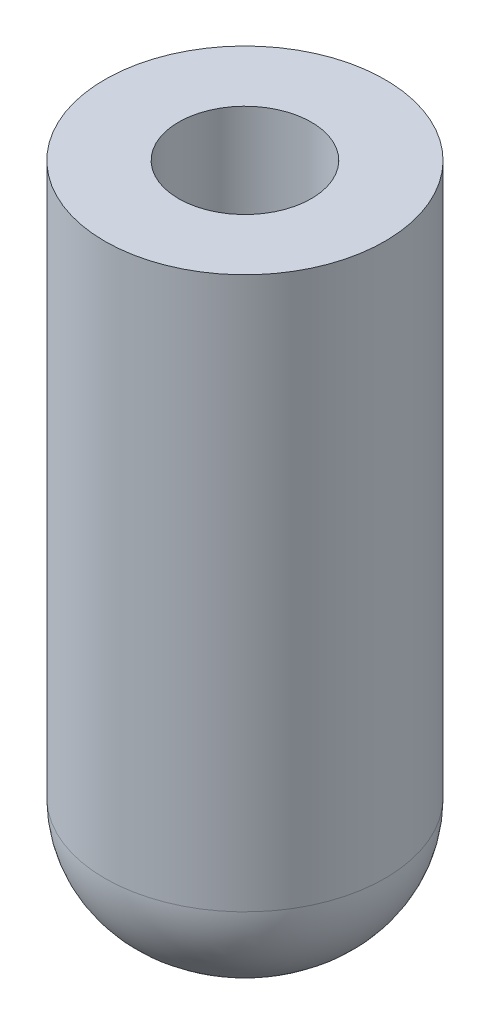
ISO-10303-21;
HEADER;
FILE_DESCRIPTION(('STEP AP214'),'2;1');
FILE_NAME('part.step','',(''),(''),'','','');
FILE_SCHEMA(('AUTOMOTIVE_DESIGN { 1 0 10303 214 1 1 1 1 }'));
ENDSEC;
DATA;
#1=APPLICATION_CONTEXT('core data for automotive mechanical design processes');
#2=APPLICATION_PROTOCOL_DEFINITION('international standard','automotive_design',2000,#1);
#3=PRODUCT_CONTEXT('',#1,'mechanical');
#4=PRODUCT('Part','Part','',(#3));
#5=PRODUCT_RELATED_PRODUCT_CATEGORY('part','',(#4));
#6=PRODUCT_DEFINITION_FORMATION('','',#4);
#7=PRODUCT_DEFINITION_CONTEXT('part definition',#1,'design');
#8=PRODUCT_DEFINITION('design','',#6,#7);
#9=PRODUCT_DEFINITION_SHAPE('','',#8);
#10=(LENGTH_UNIT() NAMED_UNIT(*) SI_UNIT(.MILLI.,.METRE.));
#11=(NAMED_UNIT(*) PLANE_ANGLE_UNIT() SI_UNIT($,.RADIAN.));
#12=(NAMED_UNIT(*) SI_UNIT($,.STERADIAN.) SOLID_ANGLE_UNIT());
#13=UNCERTAINTY_MEASURE_WITH_UNIT(LENGTH_MEASURE(1.E-05),#10,'distance_accuracy_value','');
#14=(GEOMETRIC_REPRESENTATION_CONTEXT(3) GLOBAL_UNCERTAINTY_ASSIGNED_CONTEXT((#13)) GLOBAL_UNIT_ASSIGNED_CONTEXT((#10,
#11,#12)) REPRESENTATION_CONTEXT('',''));
#15=CARTESIAN_POINT('',(0.,0.,0.));
#16=DIRECTION('',(0.,0.,1.));
#17=DIRECTION('',(1.,0.,0.));
#18=AXIS2_PLACEMENT_3D('',#15,#16,#17);
#19=CARTESIAN_POINT('',(0.,0.,0.));
#20=DIRECTION('',(0.,1.,0.));
#21=DIRECTION('',(0.,0.,1.));
#22=AXIS2_PLACEMENT_3D('',#19,#20,#21);
#23=CYLINDRICAL_SURFACE('',#22,9.);
#24=CARTESIAN_POINT('',(0.,-30.,0.));
#25=DIRECTION('',(0.,1.,0.));
#26=DIRECTION('',(0.,0.,1.));
#27=AXIS2_PLACEMENT_3D('',#24,#25,#26);
#28=CIRCLE('',#27,9.);
#29=CARTESIAN_POINT('',(0.,-30.,9.));
#30=VERTEX_POINT('',#29);
#31=EDGE_CURVE('E11',#30,#30,#28,.T.);
#32=ORIENTED_EDGE('',*,*,#31,.F.);
#33=EDGE_LOOP('',(#32));
#34=FACE_BOUND('',#33,.T.);
#35=CARTESIAN_POINT('',(0.,0.,0.));
#36=DIRECTION('',(0.,1.,0.));
#37=DIRECTION('',(0.,0.,1.));
#38=AXIS2_PLACEMENT_3D('',#35,#36,#37);
#39=CIRCLE('',#38,9.);
#40=CARTESIAN_POINT('',(0.,0.,9.));
#41=VERTEX_POINT('',#40);
#42=EDGE_CURVE('E35',#41,#41,#39,.T.);
#43=ORIENTED_EDGE('',*,*,#42,.T.);
#44=EDGE_LOOP('',(#43));
#45=FACE_BOUND('',#44,.T.);
#46=ADVANCED_FACE('F16',(#34,#45),#23,.F.);
#47=CARTESIAN_POINT('',(0.,-30.,0.));
#48=DIRECTION('',(0.,1.,0.));
#49=DIRECTION('',(0.,0.,1.));
#50=AXIS2_PLACEMENT_3D('',#47,#48,#49);
#51=CONICAL_SURFACE('',#50,9.,1.0471975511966);
#52=CARTESIAN_POINT('',(0.,-35.1961524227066,0.));
#53=VERTEX_POINT('',#52);
#54=VERTEX_LOOP('',#53);
#55=FACE_BOUND('',#54,.T.);
#56=ORIENTED_EDGE('',*,*,#31,.T.);
#57=EDGE_LOOP('',(#56));
#58=FACE_BOUND('',#57,.T.);
#59=ADVANCED_FACE('F25',(#55,#58),#51,.F.);
#60=CARTESIAN_POINT('',(0.,-30.,0.));
#61=DIRECTION('',(0.,1.,0.));
#62=DIRECTION('',(-1.,0.,0.));
#63=AXIS2_PLACEMENT_3D('',#60,#61,#62);
#64=SPHERICAL_SURFACE('',#63,60.);
#65=CARTESIAN_POINT('',(0.,-89.7624928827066,0.));
#66=DIRECTION('',(0.,1.,0.));
#67=DIRECTION('',(0.,0.,1.));
#68=AXIS2_PLACEMENT_3D('',#65,#66,#67);
#69=CIRCLE('',#68,5.33333333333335);
#70=CARTESIAN_POINT('',(0.,-89.7624928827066,5.33333333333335));
#71=VERTEX_POINT('',#70);
#72=EDGE_CURVE('E22',#71,#71,#69,.T.);
#73=ORIENTED_EDGE('',*,*,#72,.F.);
#74=EDGE_LOOP('',(#73));
#75=FACE_BOUND('',#74,.T.);
#76=ADVANCED_FACE('F28',(#75),#64,.T.);
#77=CARTESIAN_POINT('',(0.,-74.8218696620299,0.));
#78=DIRECTION('',(0.,1.,0.));
#79=DIRECTION('',(0.,0.,1.));
#80=AXIS2_PLACEMENT_3D('',#77,#78,#79);
#81=DEGENERATE_TOROIDAL_SURFACE('',#80,4.,15.,.T.);
#82=CARTESIAN_POINT('',(0.,-74.8218696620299,0.));
#83=DIRECTION('',(0.,1.,0.));
#84=DIRECTION('',(0.,0.,1.));
#85=AXIS2_PLACEMENT_3D('',#82,#83,#84);
#86=CIRCLE('',#85,19.);
#87=CARTESIAN_POINT('',(0.,-74.8218696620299,19.));
#88=VERTEX_POINT('',#87);
#89=EDGE_CURVE('E40',#88,#88,#86,.T.);
#90=ORIENTED_EDGE('',*,*,#89,.F.);
#91=EDGE_LOOP('',(#90));
#92=FACE_BOUND('',#91,.T.);
#93=ORIENTED_EDGE('',*,*,#72,.T.);
#94=EDGE_LOOP('',(#93));
#95=FACE_BOUND('',#94,.T.);
#96=ADVANCED_FACE('F47',(#92,#95),#81,.T.);
#97=CARTESIAN_POINT('',(0.,0.,0.));
#98=DIRECTION('',(0.,1.,0.));
#99=DIRECTION('',(0.,0.,1.));
#100=AXIS2_PLACEMENT_3D('',#97,#98,#99);
#101=CYLINDRICAL_SURFACE('',#100,19.);
#102=CARTESIAN_POINT('',(0.,0.,0.));
#103=DIRECTION('',(0.,1.,0.));
#104=DIRECTION('',(0.,0.,1.));
#105=AXIS2_PLACEMENT_3D('',#102,#103,#104);
#106=CIRCLE('',#105,19.);
#107=CARTESIAN_POINT('',(0.,0.,19.));
#108=VERTEX_POINT('',#107);
#109=EDGE_CURVE('E37',#108,#108,#106,.T.);
#110=ORIENTED_EDGE('',*,*,#109,.F.);
#111=EDGE_LOOP('',(#110));
#112=FACE_BOUND('',#111,.T.);
#113=ORIENTED_EDGE('',*,*,#89,.T.);
#114=EDGE_LOOP('',(#113));
#115=FACE_BOUND('',#114,.T.);
#116=ADVANCED_FACE('F56',(#112,#115),#101,.T.);
#117=CARTESIAN_POINT('',(9.,0.,0.));
#118=DIRECTION('',(0.,-1.,0.));
#119=DIRECTION('',(0.,0.,-1.));
#120=AXIS2_PLACEMENT_3D('',#117,#118,#119);
#121=PLANE('',#120);
#122=ORIENTED_EDGE('',*,*,#42,.F.);
#123=EDGE_LOOP('',(#122));
#124=FACE_BOUND('',#123,.T.);
#125=ORIENTED_EDGE('',*,*,#109,.T.);
#126=EDGE_LOOP('',(#125));
#127=FACE_BOUND('',#126,.T.);
#128=ADVANCED_FACE('F62',(#124,#127),#121,.F.);
#129=CLOSED_SHELL('',(#46,#59,#76,#96,#116,#128));
#130=MANIFOLD_SOLID_BREP('B1',#129);
#131=ADVANCED_BREP_SHAPE_REPRESENTATION('',(#18,#130),#14);
#132=SHAPE_DEFINITION_REPRESENTATION(#9,#131);
ENDSEC;
END-ISO-10303-21;
